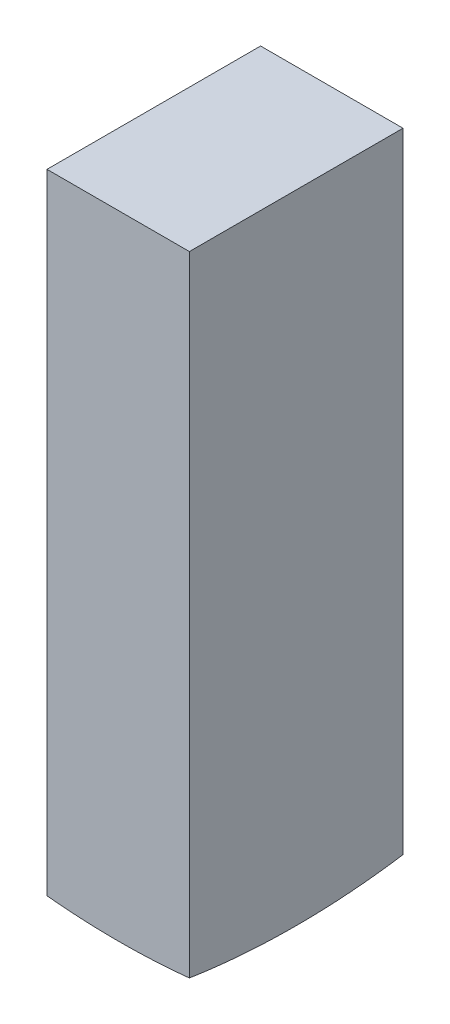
ISO-10303-21;
HEADER;
FILE_DESCRIPTION(('STEP AP214'),'2;1');
FILE_NAME('part.step','',(''),(''),'','','');
FILE_SCHEMA(('AUTOMOTIVE_DESIGN { 1 0 10303 214 1 1 1 1 }'));
ENDSEC;
DATA;
#1=APPLICATION_CONTEXT('core data for automotive mechanical design processes');
#2=APPLICATION_PROTOCOL_DEFINITION('international standard','automotive_design',2000,#1);
#3=PRODUCT_CONTEXT('',#1,'mechanical');
#4=PRODUCT('Part','Part','',(#3));
#5=PRODUCT_RELATED_PRODUCT_CATEGORY('part','',(#4));
#6=PRODUCT_DEFINITION_FORMATION('','',#4);
#7=PRODUCT_DEFINITION_CONTEXT('part definition',#1,'design');
#8=PRODUCT_DEFINITION('design','',#6,#7);
#9=PRODUCT_DEFINITION_SHAPE('','',#8);
#10=(LENGTH_UNIT() NAMED_UNIT(*) SI_UNIT(.MILLI.,.METRE.));
#11=(NAMED_UNIT(*) PLANE_ANGLE_UNIT() SI_UNIT($,.RADIAN.));
#12=(NAMED_UNIT(*) SI_UNIT($,.STERADIAN.) SOLID_ANGLE_UNIT());
#13=UNCERTAINTY_MEASURE_WITH_UNIT(LENGTH_MEASURE(1.E-05),#10,'distance_accuracy_value','');
#14=(GEOMETRIC_REPRESENTATION_CONTEXT(3) GLOBAL_UNCERTAINTY_ASSIGNED_CONTEXT((#13)) GLOBAL_UNIT_ASSIGNED_CONTEXT((#10,
#11,#12)) REPRESENTATION_CONTEXT('',''));
#15=CARTESIAN_POINT('',(0.,0.,0.));
#16=DIRECTION('',(0.,0.,1.));
#17=DIRECTION('',(1.,0.,0.));
#18=AXIS2_PLACEMENT_3D('',#15,#16,#17);
#19=CARTESIAN_POINT('',(-2.,0.,3.));
#20=DIRECTION('',(1.,0.,0.));
#21=DIRECTION('',(0.,0.,-1.));
#22=AXIS2_PLACEMENT_3D('',#19,#20,#21);
#23=PLANE('',#22);
#24=CARTESIAN_POINT('',(-2.,20.,0.));
#25=DIRECTION('',(1.,0.,0.));
#26=DIRECTION('',(0.,0.,-1.));
#27=AXIS2_PLACEMENT_3D('',#24,#25,#26);
#28=CIRCLE('',#27,19.8997487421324);
#29=CARTESIAN_POINT('',(-2.,0.327684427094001,3.));
#30=VERTEX_POINT('',#29);
#31=CARTESIAN_POINT('',(-2.,0.327684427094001,-3.));
#32=VERTEX_POINT('',#31);
#33=EDGE_CURVE('E45',#30,#32,#28,.T.);
#34=ORIENTED_EDGE('',*,*,#33,.F.);
#35=DIRECTION('',(0.,-1.,0.));
#36=VECTOR('',#35,1.);
#37=CARTESIAN_POINT('',(-2.,0.,3.));
#38=LINE('',#37,#36);
#39=CARTESIAN_POINT('',(-2.,18.,3.));
#40=VERTEX_POINT('',#39);
#41=EDGE_CURVE('E92',#40,#30,#38,.T.);
#42=ORIENTED_EDGE('',*,*,#41,.F.);
#43=DIRECTION('',(0.,0.,-1.));
#44=VECTOR('',#43,1.);
#45=CARTESIAN_POINT('',(-2.,18.,3.));
#46=LINE('',#45,#44);
#47=CARTESIAN_POINT('',(-2.,18.,-3.));
#48=VERTEX_POINT('',#47);
#49=EDGE_CURVE('E101',#40,#48,#46,.T.);
#50=ORIENTED_EDGE('',*,*,#49,.T.);
#51=DIRECTION('',(0.,-1.,0.));
#52=VECTOR('',#51,1.);
#53=CARTESIAN_POINT('',(-2.,0.,-3.));
#54=LINE('',#53,#52);
#55=EDGE_CURVE('E90',#48,#32,#54,.T.);
#56=ORIENTED_EDGE('',*,*,#55,.T.);
#57=EDGE_LOOP('',(#34,#42,#50,#56));
#58=FACE_BOUND('',#57,.T.);
#59=ADVANCED_FACE('F31',(#58),#23,.F.);
#60=CARTESIAN_POINT('',(2.,0.,3.));
#61=DIRECTION('',(-1.,0.,0.));
#62=DIRECTION('',(0.,0.,1.));
#63=AXIS2_PLACEMENT_3D('',#60,#61,#62);
#64=PLANE('',#63);
#65=CARTESIAN_POINT('',(2.,20.,0.));
#66=DIRECTION('',(-1.,0.,0.));
#67=DIRECTION('',(0.,0.,1.));
#68=AXIS2_PLACEMENT_3D('',#65,#66,#67);
#69=CIRCLE('',#68,19.8997487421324);
#70=CARTESIAN_POINT('',(2.,0.327684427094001,-3.));
#71=VERTEX_POINT('',#70);
#72=CARTESIAN_POINT('',(2.,0.327684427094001,3.));
#73=VERTEX_POINT('',#72);
#74=EDGE_CURVE('E73',#71,#73,#69,.T.);
#75=ORIENTED_EDGE('',*,*,#74,.F.);
#76=DIRECTION('',(0.,1.,0.));
#77=VECTOR('',#76,1.);
#78=CARTESIAN_POINT('',(2.,0.,-3.));
#79=LINE('',#78,#77);
#80=CARTESIAN_POINT('',(2.,18.,-3.));
#81=VERTEX_POINT('',#80);
#82=EDGE_CURVE('E83',#71,#81,#79,.T.);
#83=ORIENTED_EDGE('',*,*,#82,.T.);
#84=DIRECTION('',(0.,0.,-1.));
#85=VECTOR('',#84,1.);
#86=CARTESIAN_POINT('',(2.,18.,3.));
#87=LINE('',#86,#85);
#88=CARTESIAN_POINT('',(2.,18.,3.));
#89=VERTEX_POINT('',#88);
#90=EDGE_CURVE('E38',#89,#81,#87,.T.);
#91=ORIENTED_EDGE('',*,*,#90,.F.);
#92=DIRECTION('',(0.,1.,0.));
#93=VECTOR('',#92,1.);
#94=CARTESIAN_POINT('',(2.,0.,3.));
#95=LINE('',#94,#93);
#96=EDGE_CURVE('E85',#73,#89,#95,.T.);
#97=ORIENTED_EDGE('',*,*,#96,.F.);
#98=EDGE_LOOP('',(#75,#83,#91,#97));
#99=FACE_BOUND('',#98,.T.);
#100=ADVANCED_FACE('F81',(#99),#64,.F.);
#101=CARTESIAN_POINT('',(-2.,18.,3.));
#102=DIRECTION('',(0.,0.,-1.));
#103=DIRECTION('',(-1.,0.,0.));
#104=AXIS2_PLACEMENT_3D('',#101,#102,#103);
#105=PLANE('',#104);
#106=CARTESIAN_POINT('',(0.,20.,3.));
#107=DIRECTION('',(0.,0.,-1.));
#108=DIRECTION('',(-1.,0.,0.));
#109=AXIS2_PLACEMENT_3D('',#106,#107,#108);
#110=CIRCLE('',#109,19.7737199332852);
#111=EDGE_CURVE('E94',#73,#30,#110,.T.);
#112=ORIENTED_EDGE('',*,*,#111,.F.);
#113=ORIENTED_EDGE('',*,*,#96,.T.);
#114=DIRECTION('',(-1.,0.,0.));
#115=VECTOR('',#114,1.);
#116=CARTESIAN_POINT('',(-2.,18.,3.));
#117=LINE('',#116,#115);
#118=EDGE_CURVE('E52',#89,#40,#117,.T.);
#119=ORIENTED_EDGE('',*,*,#118,.T.);
#120=ORIENTED_EDGE('',*,*,#41,.T.);
#121=EDGE_LOOP('',(#112,#113,#119,#120));
#122=FACE_BOUND('',#121,.T.);
#123=ADVANCED_FACE('F107',(#122),#105,.F.);
#124=CARTESIAN_POINT('',(-2.,18.,-3.));
#125=DIRECTION('',(0.,0.,-1.));
#126=DIRECTION('',(-1.,0.,0.));
#127=AXIS2_PLACEMENT_3D('',#124,#125,#126);
#128=PLANE('',#127);
#129=ORIENTED_EDGE('',*,*,#82,.F.);
#130=CARTESIAN_POINT('',(0.,20.,-3.));
#131=DIRECTION('',(0.,0.,-1.));
#132=DIRECTION('',(-1.,0.,0.));
#133=AXIS2_PLACEMENT_3D('',#130,#131,#132);
#134=CIRCLE('',#133,19.7737199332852);
#135=EDGE_CURVE('E11',#71,#32,#134,.T.);
#136=ORIENTED_EDGE('',*,*,#135,.T.);
#137=ORIENTED_EDGE('',*,*,#55,.F.);
#138=DIRECTION('',(-1.,0.,0.));
#139=VECTOR('',#138,1.);
#140=CARTESIAN_POINT('',(-2.,18.,-3.));
#141=LINE('',#140,#139);
#142=EDGE_CURVE('E89',#81,#48,#141,.T.);
#143=ORIENTED_EDGE('',*,*,#142,.F.);
#144=EDGE_LOOP('',(#129,#136,#137,#143));
#145=FACE_BOUND('',#144,.T.);
#146=ADVANCED_FACE('F88',(#145),#128,.T.);
#147=CARTESIAN_POINT('',(-2.,18.,3.));
#148=DIRECTION('',(0.,-1.,0.));
#149=DIRECTION('',(0.,0.,-1.));
#150=AXIS2_PLACEMENT_3D('',#147,#148,#149);
#151=PLANE('',#150);
#152=ORIENTED_EDGE('',*,*,#142,.T.);
#153=ORIENTED_EDGE('',*,*,#49,.F.);
#154=ORIENTED_EDGE('',*,*,#118,.F.);
#155=ORIENTED_EDGE('',*,*,#90,.T.);
#156=EDGE_LOOP('',(#152,#153,#154,#155));
#157=FACE_BOUND('',#156,.T.);
#158=ADVANCED_FACE('F104',(#157),#151,.F.);
#159=CARTESIAN_POINT('',(0.,20.,0.));
#160=DIRECTION('',(0.,-1.,0.));
#161=DIRECTION('',(1.,0.,0.));
#162=AXIS2_PLACEMENT_3D('',#159,#160,#161);
#163=SPHERICAL_SURFACE('',#162,20.);
#164=CARTESIAN_POINT('',(0.,0.,0.));
#165=VERTEX_POINT('',#164);
#166=VERTEX_LOOP('',#165);
#167=FACE_BOUND('',#166,.T.);
#168=ORIENTED_EDGE('',*,*,#111,.T.);
#169=ORIENTED_EDGE('',*,*,#33,.T.);
#170=ORIENTED_EDGE('',*,*,#135,.F.);
#171=ORIENTED_EDGE('',*,*,#74,.T.);
#172=EDGE_LOOP('',(#168,#169,#170,#171));
#173=FACE_BOUND('',#172,.T.);
#174=ADVANCED_FACE('F72',(#167,#173),#163,.T.);
#175=CLOSED_SHELL('',(#59,#100,#123,#146,#158,#174));
#176=MANIFOLD_SOLID_BREP('B2',#175);
#177=ADVANCED_BREP_SHAPE_REPRESENTATION('',(#18,#176),#14);
#178=SHAPE_DEFINITION_REPRESENTATION(#9,#177);
ENDSEC;
END-ISO-10303-21;
